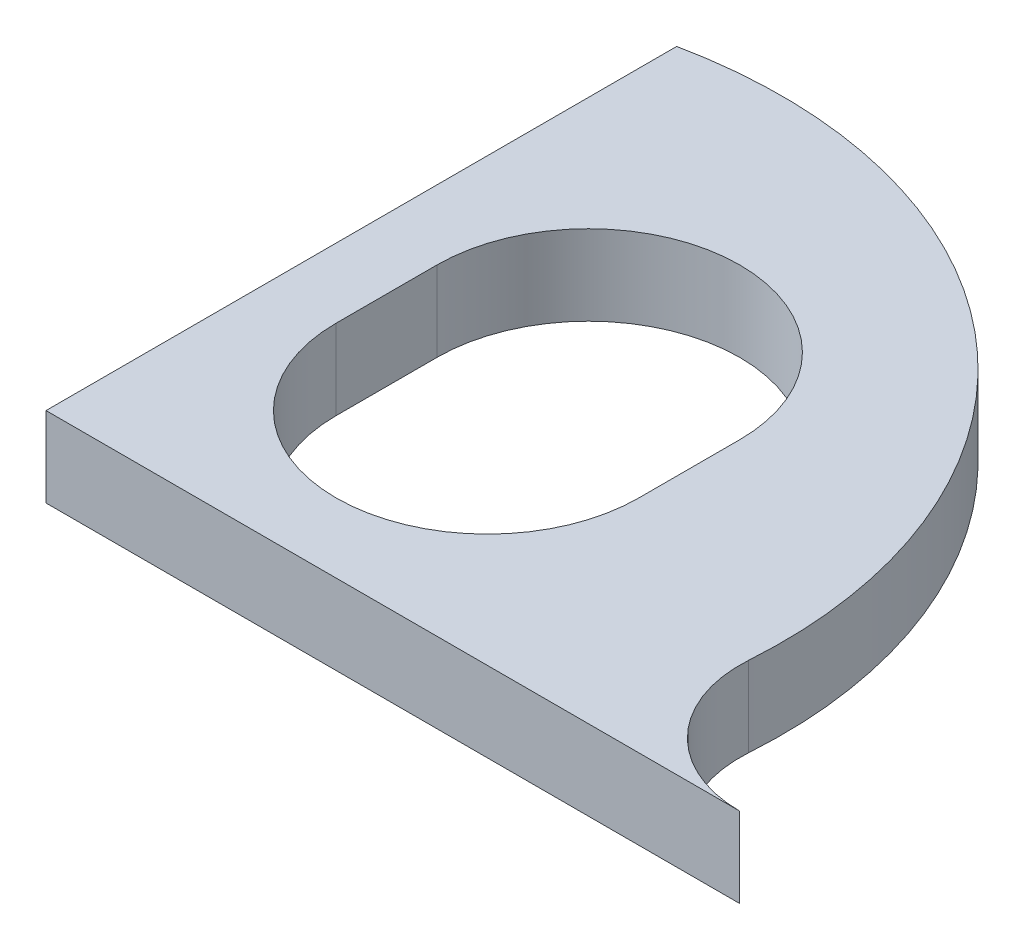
ISO-10303-21;
HEADER;
FILE_DESCRIPTION(('STEP AP214'),'2;1');
FILE_NAME('part.step','',(''),(''),'','','');
FILE_SCHEMA(('AUTOMOTIVE_DESIGN { 1 0 10303 214 1 1 1 1 }'));
ENDSEC;
DATA;
#1=APPLICATION_CONTEXT('core data for automotive mechanical design processes');
#2=APPLICATION_PROTOCOL_DEFINITION('international standard','automotive_design',2000,#1);
#3=PRODUCT_CONTEXT('',#1,'mechanical');
#4=PRODUCT('Part','Part','',(#3));
#5=PRODUCT_RELATED_PRODUCT_CATEGORY('part','',(#4));
#6=PRODUCT_DEFINITION_FORMATION('','',#4);
#7=PRODUCT_DEFINITION_CONTEXT('part definition',#1,'design');
#8=PRODUCT_DEFINITION('design','',#6,#7);
#9=PRODUCT_DEFINITION_SHAPE('','',#8);
#10=(LENGTH_UNIT() NAMED_UNIT(*) SI_UNIT(.MILLI.,.METRE.));
#11=(NAMED_UNIT(*) PLANE_ANGLE_UNIT() SI_UNIT($,.RADIAN.));
#12=(NAMED_UNIT(*) SI_UNIT($,.STERADIAN.) SOLID_ANGLE_UNIT());
#13=UNCERTAINTY_MEASURE_WITH_UNIT(LENGTH_MEASURE(1.E-05),#10,'distance_accuracy_value','');
#14=(GEOMETRIC_REPRESENTATION_CONTEXT(3) GLOBAL_UNCERTAINTY_ASSIGNED_CONTEXT((#13)) GLOBAL_UNIT_ASSIGNED_CONTEXT((#10,
#11,#12)) REPRESENTATION_CONTEXT('',''));
#15=CARTESIAN_POINT('',(0.,0.,0.));
#16=DIRECTION('',(0.,0.,1.));
#17=DIRECTION('',(1.,0.,0.));
#18=AXIS2_PLACEMENT_3D('',#15,#16,#17);
#19=CARTESIAN_POINT('',(7.58791257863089,6.35,-13.2757085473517));
#20=DIRECTION('',(0.,1.,0.));
#21=DIRECTION('',(0.,0.,1.));
#22=AXIS2_PLACEMENT_3D('',#19,#20,#21);
#23=PLANE('',#22);
#24=DIRECTION('',(0.,0.,1.));
#25=VECTOR('',#24,1.);
#26=CARTESIAN_POINT('',(0.,6.35,0.));
#27=LINE('',#26,#25);
#28=CARTESIAN_POINT('',(0.,6.35,-50.));
#29=VERTEX_POINT('',#28);
#30=CARTESIAN_POINT('',(0.,6.35,0.));
#31=VERTEX_POINT('',#30);
#32=EDGE_CURVE('E153',#29,#31,#27,.T.);
#33=ORIENTED_EDGE('',*,*,#32,.T.);
#34=DIRECTION('',(1.,0.,0.));
#35=VECTOR('',#34,1.);
#36=CARTESIAN_POINT('',(0.,6.35,0.));
#37=LINE('',#36,#35);
#38=CARTESIAN_POINT('',(55.,6.35,0.));
#39=VERTEX_POINT('',#38);
#40=EDGE_CURVE('E156',#31,#39,#37,.T.);
#41=ORIENTED_EDGE('',*,*,#40,.T.);
#42=CARTESIAN_POINT('',(55.,6.35,-10.023498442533));
#43=DIRECTION('',(0.,-1.,0.));
#44=DIRECTION('',(0.,0.,1.));
#45=AXIS2_PLACEMENT_3D('',#42,#43,#44);
#46=CIRCLE('',#45,10.023498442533);
#47=CARTESIAN_POINT('',(45.,6.35,-10.7094437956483));
#48=VERTEX_POINT('',#47);
#49=EDGE_CURVE('E159',#39,#48,#46,.T.);
#50=ORIENTED_EDGE('',*,*,#49,.T.);
#51=CARTESIAN_POINT('',(7.58791257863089,6.35,-13.2757085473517));
#52=DIRECTION('',(0.,1.,0.));
#53=DIRECTION('',(0.,0.,1.));
#54=AXIS2_PLACEMENT_3D('',#51,#52,#53);
#55=CIRCLE('',#54,37.5);
#56=EDGE_CURVE('E161',#48,#29,#55,.T.);
#57=ORIENTED_EDGE('',*,*,#56,.T.);
#58=EDGE_LOOP('',(#33,#41,#50,#57));
#59=FACE_BOUND('',#58,.T.);
#60=DIRECTION('',(0.,0.,-1.));
#61=VECTOR('',#60,1.);
#62=CARTESIAN_POINT('',(29.5,6.35,-17.5));
#63=LINE('',#62,#61);
#64=CARTESIAN_POINT('',(29.5,6.35,-17.5));
#65=VERTEX_POINT('',#64);
#66=CARTESIAN_POINT('',(29.5,6.35,-25.5));
#67=VERTEX_POINT('',#66);
#68=EDGE_CURVE('E125',#65,#67,#63,.T.);
#69=ORIENTED_EDGE('',*,*,#68,.F.);
#70=CARTESIAN_POINT('',(17.5,6.35,-17.5));
#71=DIRECTION('',(0.,1.,0.));
#72=DIRECTION('',(0.,0.,1.));
#73=AXIS2_PLACEMENT_3D('',#70,#71,#72);
#74=CIRCLE('',#73,12.);
#75=CARTESIAN_POINT('',(5.5,6.35,-17.5));
#76=VERTEX_POINT('',#75);
#77=EDGE_CURVE('E117',#76,#65,#74,.T.);
#78=ORIENTED_EDGE('',*,*,#77,.F.);
#79=DIRECTION('',(0.,0.,1.));
#80=VECTOR('',#79,1.);
#81=CARTESIAN_POINT('',(5.5,6.35,-17.5));
#82=LINE('',#81,#80);
#83=CARTESIAN_POINT('',(5.5,6.35,-25.5));
#84=VERTEX_POINT('',#83);
#85=EDGE_CURVE('E139',#84,#76,#82,.T.);
#86=ORIENTED_EDGE('',*,*,#85,.F.);
#87=CARTESIAN_POINT('',(17.5,6.35,-25.5));
#88=DIRECTION('',(0.,1.,0.));
#89=DIRECTION('',(0.,0.,1.));
#90=AXIS2_PLACEMENT_3D('',#87,#88,#89);
#91=CIRCLE('',#90,12.);
#92=EDGE_CURVE('E137',#67,#84,#91,.T.);
#93=ORIENTED_EDGE('',*,*,#92,.F.);
#94=EDGE_LOOP('',(#69,#78,#86,#93));
#95=FACE_BOUND('',#94,.T.);
#96=ADVANCED_FACE('F52',(#59,#95),#23,.T.);
#97=CARTESIAN_POINT('',(7.58791257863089,0.,-13.2757085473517));
#98=DIRECTION('',(0.,1.,0.));
#99=DIRECTION('',(0.,0.,1.));
#100=AXIS2_PLACEMENT_3D('',#97,#98,#99);
#101=PLANE('',#100);
#102=DIRECTION('',(0.,0.,1.));
#103=VECTOR('',#102,1.);
#104=CARTESIAN_POINT('',(0.,0.,0.));
#105=LINE('',#104,#103);
#106=CARTESIAN_POINT('',(0.,0.,-50.));
#107=VERTEX_POINT('',#106);
#108=CARTESIAN_POINT('',(0.,0.,0.));
#109=VERTEX_POINT('',#108);
#110=EDGE_CURVE('E133',#107,#109,#105,.T.);
#111=ORIENTED_EDGE('',*,*,#110,.F.);
#112=CARTESIAN_POINT('',(7.58791257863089,0.,-13.2757085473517));
#113=DIRECTION('',(0.,1.,0.));
#114=DIRECTION('',(0.,0.,1.));
#115=AXIS2_PLACEMENT_3D('',#112,#113,#114);
#116=CIRCLE('',#115,37.5);
#117=CARTESIAN_POINT('',(45.,0.,-10.7094437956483));
#118=VERTEX_POINT('',#117);
#119=EDGE_CURVE('E157',#118,#107,#116,.T.);
#120=ORIENTED_EDGE('',*,*,#119,.F.);
#121=CARTESIAN_POINT('',(55.,0.,-10.023498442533));
#122=DIRECTION('',(0.,-1.,0.));
#123=DIRECTION('',(0.,0.,1.));
#124=AXIS2_PLACEMENT_3D('',#121,#122,#123);
#125=CIRCLE('',#124,10.023498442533);
#126=CARTESIAN_POINT('',(55.,0.,0.));
#127=VERTEX_POINT('',#126);
#128=EDGE_CURVE('E168',#127,#118,#125,.T.);
#129=ORIENTED_EDGE('',*,*,#128,.F.);
#130=DIRECTION('',(1.,0.,0.));
#131=VECTOR('',#130,1.);
#132=CARTESIAN_POINT('',(45.,0.,0.));
#133=LINE('',#132,#131);
#134=EDGE_CURVE('E166',#109,#127,#133,.T.);
#135=ORIENTED_EDGE('',*,*,#134,.F.);
#136=EDGE_LOOP('',(#111,#120,#129,#135));
#137=FACE_BOUND('',#136,.T.);
#138=CARTESIAN_POINT('',(17.5,0.,-17.5));
#139=DIRECTION('',(0.,1.,0.));
#140=DIRECTION('',(0.,0.,1.));
#141=AXIS2_PLACEMENT_3D('',#138,#139,#140);
#142=CIRCLE('',#141,12.);
#143=CARTESIAN_POINT('',(5.5,0.,-17.5));
#144=VERTEX_POINT('',#143);
#145=CARTESIAN_POINT('',(29.5,0.,-17.5));
#146=VERTEX_POINT('',#145);
#147=EDGE_CURVE('E75',#144,#146,#142,.T.);
#148=ORIENTED_EDGE('',*,*,#147,.T.);
#149=DIRECTION('',(0.,0.,-1.));
#150=VECTOR('',#149,1.);
#151=CARTESIAN_POINT('',(29.5,0.,-17.5));
#152=LINE('',#151,#150);
#153=CARTESIAN_POINT('',(29.5,0.,-25.5));
#154=VERTEX_POINT('',#153);
#155=EDGE_CURVE('E132',#146,#154,#152,.T.);
#156=ORIENTED_EDGE('',*,*,#155,.T.);
#157=CARTESIAN_POINT('',(17.5,0.,-25.5));
#158=DIRECTION('',(0.,1.,0.));
#159=DIRECTION('',(0.,0.,1.));
#160=AXIS2_PLACEMENT_3D('',#157,#158,#159);
#161=CIRCLE('',#160,12.);
#162=CARTESIAN_POINT('',(5.5,0.,-25.5));
#163=VERTEX_POINT('',#162);
#164=EDGE_CURVE('E145',#154,#163,#161,.T.);
#165=ORIENTED_EDGE('',*,*,#164,.T.);
#166=DIRECTION('',(0.,0.,1.));
#167=VECTOR('',#166,1.);
#168=CARTESIAN_POINT('',(5.5,0.,-17.5));
#169=LINE('',#168,#167);
#170=EDGE_CURVE('E126',#163,#144,#169,.T.);
#171=ORIENTED_EDGE('',*,*,#170,.T.);
#172=EDGE_LOOP('',(#148,#156,#165,#171));
#173=FACE_BOUND('',#172,.T.);
#174=ADVANCED_FACE('F186',(#137,#173),#101,.F.);
#175=CARTESIAN_POINT('',(0.,6.35,0.));
#176=DIRECTION('',(1.,0.,0.));
#177=DIRECTION('',(0.,0.,-1.));
#178=AXIS2_PLACEMENT_3D('',#175,#176,#177);
#179=PLANE('',#178);
#180=ORIENTED_EDGE('',*,*,#110,.T.);
#181=DIRECTION('',(0.,-1.,0.));
#182=VECTOR('',#181,1.);
#183=CARTESIAN_POINT('',(0.,6.35,0.));
#184=LINE('',#183,#182);
#185=EDGE_CURVE('E13',#31,#109,#184,.T.);
#186=ORIENTED_EDGE('',*,*,#185,.F.);
#187=ORIENTED_EDGE('',*,*,#32,.F.);
#188=DIRECTION('',(0.,-1.,0.));
#189=VECTOR('',#188,1.);
#190=CARTESIAN_POINT('',(0.,6.35,-50.));
#191=LINE('',#190,#189);
#192=EDGE_CURVE('E163',#29,#107,#191,.T.);
#193=ORIENTED_EDGE('',*,*,#192,.T.);
#194=EDGE_LOOP('',(#180,#186,#187,#193));
#195=FACE_BOUND('',#194,.T.);
#196=ADVANCED_FACE('F54',(#195),#179,.F.);
#197=CARTESIAN_POINT('',(45.,6.35,0.));
#198=DIRECTION('',(0.,0.,-1.));
#199=DIRECTION('',(-1.,0.,0.));
#200=AXIS2_PLACEMENT_3D('',#197,#198,#199);
#201=PLANE('',#200);
#202=ORIENTED_EDGE('',*,*,#134,.T.);
#203=DIRECTION('',(0.,-1.,0.));
#204=VECTOR('',#203,1.);
#205=CARTESIAN_POINT('',(55.,6.35,0.));
#206=LINE('',#205,#204);
#207=EDGE_CURVE('E60',#39,#127,#206,.T.);
#208=ORIENTED_EDGE('',*,*,#207,.F.);
#209=ORIENTED_EDGE('',*,*,#40,.F.);
#210=ORIENTED_EDGE('',*,*,#185,.T.);
#211=EDGE_LOOP('',(#202,#208,#209,#210));
#212=FACE_BOUND('',#211,.T.);
#213=ADVANCED_FACE('F196',(#212),#201,.F.);
#214=CARTESIAN_POINT('',(55.,6.35,-10.023498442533));
#215=DIRECTION('',(0.,-1.,0.));
#216=DIRECTION('',(0.,0.,-1.));
#217=AXIS2_PLACEMENT_3D('',#214,#215,#216);
#218=CYLINDRICAL_SURFACE('',#217,10.023498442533);
#219=ORIENTED_EDGE('',*,*,#128,.T.);
#220=DIRECTION('',(0.,-1.,0.));
#221=VECTOR('',#220,1.);
#222=CARTESIAN_POINT('',(45.,6.35,-10.7094437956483));
#223=LINE('',#222,#221);
#224=EDGE_CURVE('E173',#48,#118,#223,.T.);
#225=ORIENTED_EDGE('',*,*,#224,.F.);
#226=ORIENTED_EDGE('',*,*,#49,.F.);
#227=ORIENTED_EDGE('',*,*,#207,.T.);
#228=EDGE_LOOP('',(#219,#225,#226,#227));
#229=FACE_BOUND('',#228,.T.);
#230=ADVANCED_FACE('F180',(#229),#218,.F.);
#231=CARTESIAN_POINT('',(7.58791257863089,6.35,-13.2757085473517));
#232=DIRECTION('',(0.,-1.,0.));
#233=DIRECTION('',(0.,0.,-1.));
#234=AXIS2_PLACEMENT_3D('',#231,#232,#233);
#235=CYLINDRICAL_SURFACE('',#234,37.5);
#236=ORIENTED_EDGE('',*,*,#119,.T.);
#237=ORIENTED_EDGE('',*,*,#192,.F.);
#238=ORIENTED_EDGE('',*,*,#56,.F.);
#239=ORIENTED_EDGE('',*,*,#224,.T.);
#240=EDGE_LOOP('',(#236,#237,#238,#239));
#241=FACE_BOUND('',#240,.T.);
#242=ADVANCED_FACE('F190',(#241),#235,.T.);
#243=CARTESIAN_POINT('',(17.5,6.35,-17.5));
#244=DIRECTION('',(0.,-1.,0.));
#245=DIRECTION('',(0.,0.,-1.));
#246=AXIS2_PLACEMENT_3D('',#243,#244,#245);
#247=CYLINDRICAL_SURFACE('',#246,12.);
#248=ORIENTED_EDGE('',*,*,#147,.F.);
#249=DIRECTION('',(0.,-1.,0.));
#250=VECTOR('',#249,1.);
#251=CARTESIAN_POINT('',(5.5,6.35,-17.5));
#252=LINE('',#251,#250);
#253=EDGE_CURVE('E121',#76,#144,#252,.T.);
#254=ORIENTED_EDGE('',*,*,#253,.F.);
#255=ORIENTED_EDGE('',*,*,#77,.T.);
#256=DIRECTION('',(0.,-1.,0.));
#257=VECTOR('',#256,1.);
#258=CARTESIAN_POINT('',(29.5,6.35,-17.5));
#259=LINE('',#258,#257);
#260=EDGE_CURVE('E120',#65,#146,#259,.T.);
#261=ORIENTED_EDGE('',*,*,#260,.T.);
#262=EDGE_LOOP('',(#248,#254,#255,#261));
#263=FACE_BOUND('',#262,.T.);
#264=ADVANCED_FACE('F119',(#263),#247,.F.);
#265=CARTESIAN_POINT('',(29.5,6.35,-17.5));
#266=DIRECTION('',(-1.,0.,0.));
#267=DIRECTION('',(0.,0.,1.));
#268=AXIS2_PLACEMENT_3D('',#265,#266,#267);
#269=PLANE('',#268);
#270=ORIENTED_EDGE('',*,*,#155,.F.);
#271=ORIENTED_EDGE('',*,*,#260,.F.);
#272=ORIENTED_EDGE('',*,*,#68,.T.);
#273=DIRECTION('',(0.,-1.,0.));
#274=VECTOR('',#273,1.);
#275=CARTESIAN_POINT('',(29.5,6.35,-25.5));
#276=LINE('',#275,#274);
#277=EDGE_CURVE('E134',#67,#154,#276,.T.);
#278=ORIENTED_EDGE('',*,*,#277,.T.);
#279=EDGE_LOOP('',(#270,#271,#272,#278));
#280=FACE_BOUND('',#279,.T.);
#281=ADVANCED_FACE('F129',(#280),#269,.T.);
#282=CARTESIAN_POINT('',(17.5,6.35,-25.5));
#283=DIRECTION('',(0.,-1.,0.));
#284=DIRECTION('',(0.,0.,-1.));
#285=AXIS2_PLACEMENT_3D('',#282,#283,#284);
#286=CYLINDRICAL_SURFACE('',#285,12.);
#287=ORIENTED_EDGE('',*,*,#164,.F.);
#288=ORIENTED_EDGE('',*,*,#277,.F.);
#289=ORIENTED_EDGE('',*,*,#92,.T.);
#290=DIRECTION('',(0.,-1.,0.));
#291=VECTOR('',#290,1.);
#292=CARTESIAN_POINT('',(5.5,6.35,-25.5));
#293=LINE('',#292,#291);
#294=EDGE_CURVE('E67',#84,#163,#293,.T.);
#295=ORIENTED_EDGE('',*,*,#294,.T.);
#296=EDGE_LOOP('',(#287,#288,#289,#295));
#297=FACE_BOUND('',#296,.T.);
#298=ADVANCED_FACE('F219',(#297),#286,.F.);
#299=CARTESIAN_POINT('',(5.5,6.35,-17.5));
#300=DIRECTION('',(1.,0.,0.));
#301=DIRECTION('',(0.,0.,-1.));
#302=AXIS2_PLACEMENT_3D('',#299,#300,#301);
#303=PLANE('',#302);
#304=ORIENTED_EDGE('',*,*,#170,.F.);
#305=ORIENTED_EDGE('',*,*,#294,.F.);
#306=ORIENTED_EDGE('',*,*,#85,.T.);
#307=ORIENTED_EDGE('',*,*,#253,.T.);
#308=EDGE_LOOP('',(#304,#305,#306,#307));
#309=FACE_BOUND('',#308,.T.);
#310=ADVANCED_FACE('F223',(#309),#303,.T.);
#311=CLOSED_SHELL('',(#96,#174,#196,#213,#230,#242,#264,#281,#298,#310));
#312=MANIFOLD_SOLID_BREP('B2',#311);
#313=ADVANCED_BREP_SHAPE_REPRESENTATION('',(#18,#312),#14);
#314=SHAPE_DEFINITION_REPRESENTATION(#9,#313);
ENDSEC;
END-ISO-10303-21;
